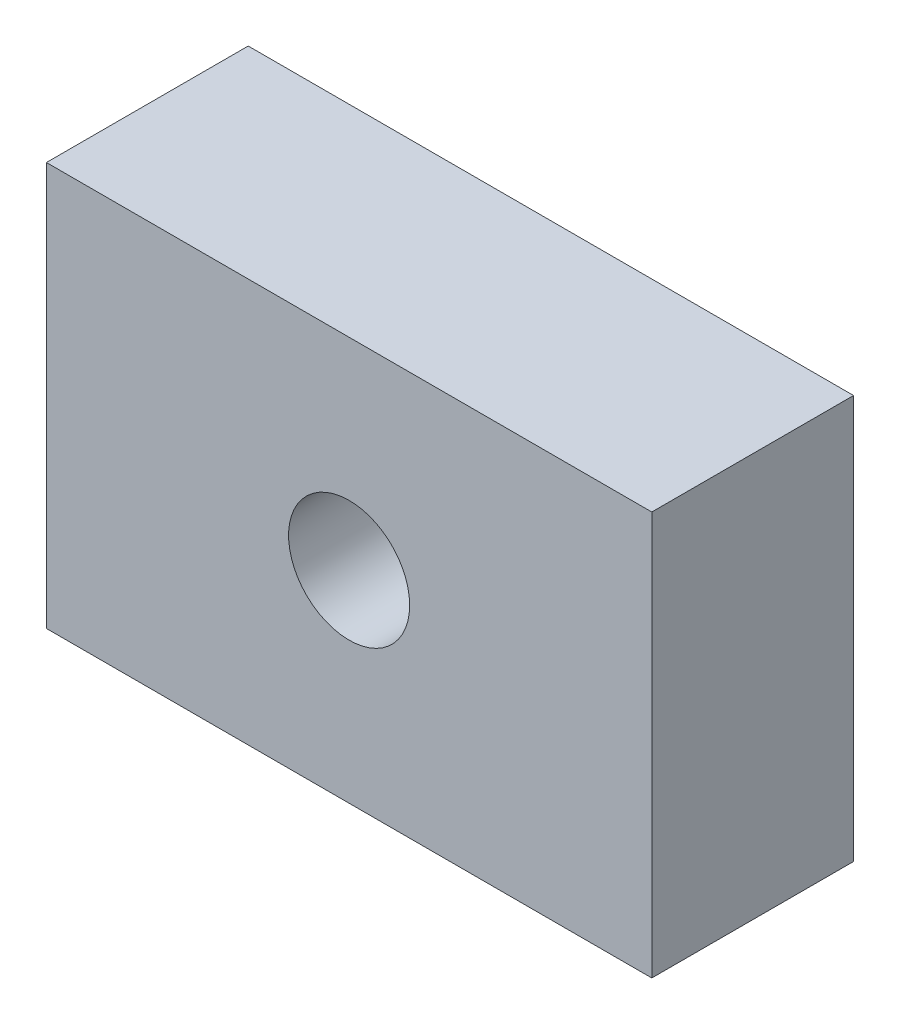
ISO-10303-21;
HEADER;
FILE_DESCRIPTION(('STEP AP214'),'2;1');
FILE_NAME('part.step','',(''),(''),'','','');
FILE_SCHEMA(('AUTOMOTIVE_DESIGN { 1 0 10303 214 1 1 1 1 }'));
ENDSEC;
DATA;
#1=APPLICATION_CONTEXT('core data for automotive mechanical design processes');
#2=APPLICATION_PROTOCOL_DEFINITION('international standard','automotive_design',2000,#1);
#3=PRODUCT_CONTEXT('',#1,'mechanical');
#4=PRODUCT('Part','Part','',(#3));
#5=PRODUCT_RELATED_PRODUCT_CATEGORY('part','',(#4));
#6=PRODUCT_DEFINITION_FORMATION('','',#4);
#7=PRODUCT_DEFINITION_CONTEXT('part definition',#1,'design');
#8=PRODUCT_DEFINITION('design','',#6,#7);
#9=PRODUCT_DEFINITION_SHAPE('','',#8);
#10=(LENGTH_UNIT() NAMED_UNIT(*) SI_UNIT(.MILLI.,.METRE.));
#11=(NAMED_UNIT(*) PLANE_ANGLE_UNIT() SI_UNIT($,.RADIAN.));
#12=(NAMED_UNIT(*) SI_UNIT($,.STERADIAN.) SOLID_ANGLE_UNIT());
#13=UNCERTAINTY_MEASURE_WITH_UNIT(LENGTH_MEASURE(1.E-05),#10,'distance_accuracy_value','');
#14=(GEOMETRIC_REPRESENTATION_CONTEXT(3) GLOBAL_UNCERTAINTY_ASSIGNED_CONTEXT((#13)) GLOBAL_UNIT_ASSIGNED_CONTEXT((#10,
#11,#12)) REPRESENTATION_CONTEXT('',''));
#15=CARTESIAN_POINT('',(0.,0.,0.));
#16=DIRECTION('',(0.,0.,1.));
#17=DIRECTION('',(1.,0.,0.));
#18=AXIS2_PLACEMENT_3D('',#15,#16,#17);
#19=CARTESIAN_POINT('',(-100.,-66.6666666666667,66.6666666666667));
#20=DIRECTION('',(1.,0.,0.));
#21=DIRECTION('',(0.,0.,-1.));
#22=AXIS2_PLACEMENT_3D('',#19,#20,#21);
#23=PLANE('',#22);
#24=DIRECTION('',(0.,-1.,0.));
#25=VECTOR('',#24,1.);
#26=CARTESIAN_POINT('',(-100.,-66.6666666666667,0.));
#27=LINE('',#26,#25);
#28=CARTESIAN_POINT('',(-100.,66.6666666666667,0.));
#29=VERTEX_POINT('',#28);
#30=CARTESIAN_POINT('',(-100.,-66.6666666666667,0.));
#31=VERTEX_POINT('',#30);
#32=EDGE_CURVE('E98',#29,#31,#27,.T.);
#33=ORIENTED_EDGE('',*,*,#32,.T.);
#34=DIRECTION('',(0.,0.,-1.));
#35=VECTOR('',#34,1.);
#36=CARTESIAN_POINT('',(-100.,-66.6666666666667,66.6666666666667));
#37=LINE('',#36,#35);
#38=CARTESIAN_POINT('',(-100.,-66.6666666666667,66.6666666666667));
#39=VERTEX_POINT('',#38);
#40=EDGE_CURVE('E11',#39,#31,#37,.T.);
#41=ORIENTED_EDGE('',*,*,#40,.F.);
#42=DIRECTION('',(0.,-1.,0.));
#43=VECTOR('',#42,1.);
#44=CARTESIAN_POINT('',(-100.,-66.6666666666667,66.6666666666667));
#45=LINE('',#44,#43);
#46=CARTESIAN_POINT('',(-100.,66.6666666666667,66.6666666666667));
#47=VERTEX_POINT('',#46);
#48=EDGE_CURVE('E86',#47,#39,#45,.T.);
#49=ORIENTED_EDGE('',*,*,#48,.F.);
#50=DIRECTION('',(0.,0.,-1.));
#51=VECTOR('',#50,1.);
#52=CARTESIAN_POINT('',(-100.,66.6666666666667,66.6666666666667));
#53=LINE('',#52,#51);
#54=EDGE_CURVE('E94',#47,#29,#53,.T.);
#55=ORIENTED_EDGE('',*,*,#54,.T.);
#56=EDGE_LOOP('',(#33,#41,#49,#55));
#57=FACE_BOUND('',#56,.T.);
#58=ADVANCED_FACE('F35',(#57),#23,.F.);
#59=CARTESIAN_POINT('',(100.,-66.6666666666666,66.6666666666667));
#60=DIRECTION('',(0.,1.,0.));
#61=DIRECTION('',(-1.,0.,0.));
#62=AXIS2_PLACEMENT_3D('',#59,#60,#61);
#63=PLANE('',#62);
#64=DIRECTION('',(1.,0.,0.));
#65=VECTOR('',#64,1.);
#66=CARTESIAN_POINT('',(100.,-66.6666666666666,0.));
#67=LINE('',#66,#65);
#68=CARTESIAN_POINT('',(100.,-66.6666666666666,0.));
#69=VERTEX_POINT('',#68);
#70=EDGE_CURVE('E90',#31,#69,#67,.T.);
#71=ORIENTED_EDGE('',*,*,#70,.T.);
#72=DIRECTION('',(0.,0.,-1.));
#73=VECTOR('',#72,1.);
#74=CARTESIAN_POINT('',(100.,-66.6666666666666,66.6666666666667));
#75=LINE('',#74,#73);
#76=CARTESIAN_POINT('',(100.,-66.6666666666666,66.6666666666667));
#77=VERTEX_POINT('',#76);
#78=EDGE_CURVE('E43',#77,#69,#75,.T.);
#79=ORIENTED_EDGE('',*,*,#78,.F.);
#80=DIRECTION('',(1.,0.,0.));
#81=VECTOR('',#80,1.);
#82=CARTESIAN_POINT('',(100.,-66.6666666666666,66.6666666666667));
#83=LINE('',#82,#81);
#84=EDGE_CURVE('E81',#39,#77,#83,.T.);
#85=ORIENTED_EDGE('',*,*,#84,.F.);
#86=ORIENTED_EDGE('',*,*,#40,.T.);
#87=EDGE_LOOP('',(#71,#79,#85,#86));
#88=FACE_BOUND('',#87,.T.);
#89=ADVANCED_FACE('F89',(#88),#63,.F.);
#90=CARTESIAN_POINT('',(100.,-66.6666666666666,66.6666666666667));
#91=DIRECTION('',(-1.,0.,0.));
#92=DIRECTION('',(0.,0.,1.));
#93=AXIS2_PLACEMENT_3D('',#90,#91,#92);
#94=PLANE('',#93);
#95=DIRECTION('',(0.,1.,0.));
#96=VECTOR('',#95,1.);
#97=CARTESIAN_POINT('',(100.,-66.6666666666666,0.));
#98=LINE('',#97,#96);
#99=CARTESIAN_POINT('',(100.,66.6666666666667,0.));
#100=VERTEX_POINT('',#99);
#101=EDGE_CURVE('E68',#69,#100,#98,.T.);
#102=ORIENTED_EDGE('',*,*,#101,.T.);
#103=DIRECTION('',(0.,0.,-1.));
#104=VECTOR('',#103,1.);
#105=CARTESIAN_POINT('',(100.,66.6666666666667,66.6666666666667));
#106=LINE('',#105,#104);
#107=CARTESIAN_POINT('',(100.,66.6666666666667,66.6666666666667));
#108=VERTEX_POINT('',#107);
#109=EDGE_CURVE('E91',#108,#100,#106,.T.);
#110=ORIENTED_EDGE('',*,*,#109,.F.);
#111=DIRECTION('',(0.,1.,0.));
#112=VECTOR('',#111,1.);
#113=CARTESIAN_POINT('',(100.,-66.6666666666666,66.6666666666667));
#114=LINE('',#113,#112);
#115=EDGE_CURVE('E84',#77,#108,#114,.T.);
#116=ORIENTED_EDGE('',*,*,#115,.F.);
#117=ORIENTED_EDGE('',*,*,#78,.T.);
#118=EDGE_LOOP('',(#102,#110,#116,#117));
#119=FACE_BOUND('',#118,.T.);
#120=ADVANCED_FACE('F92',(#119),#94,.F.);
#121=CARTESIAN_POINT('',(100.,66.6666666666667,66.6666666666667));
#122=DIRECTION('',(0.,-1.,0.));
#123=DIRECTION('',(1.,0.,0.));
#124=AXIS2_PLACEMENT_3D('',#121,#122,#123);
#125=PLANE('',#124);
#126=DIRECTION('',(-1.,0.,0.));
#127=VECTOR('',#126,1.);
#128=CARTESIAN_POINT('',(100.,66.6666666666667,0.));
#129=LINE('',#128,#127);
#130=EDGE_CURVE('E74',#100,#29,#129,.T.);
#131=ORIENTED_EDGE('',*,*,#130,.T.);
#132=ORIENTED_EDGE('',*,*,#54,.F.);
#133=DIRECTION('',(-1.,0.,0.));
#134=VECTOR('',#133,1.);
#135=CARTESIAN_POINT('',(100.,66.6666666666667,66.6666666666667));
#136=LINE('',#135,#134);
#137=EDGE_CURVE('E51',#108,#47,#136,.T.);
#138=ORIENTED_EDGE('',*,*,#137,.F.);
#139=ORIENTED_EDGE('',*,*,#109,.T.);
#140=EDGE_LOOP('',(#131,#132,#138,#139));
#141=FACE_BOUND('',#140,.T.);
#142=ADVANCED_FACE('F106',(#141),#125,.F.);
#143=CARTESIAN_POINT('',(0.,0.,66.6666666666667));
#144=DIRECTION('',(0.,0.,1.));
#145=DIRECTION('',(1.,0.,0.));
#146=AXIS2_PLACEMENT_3D('',#143,#144,#145);
#147=PLANE('',#146);
#148=CARTESIAN_POINT('',(0.,0.,66.6666666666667));
#149=DIRECTION('',(0.,0.,1.));
#150=DIRECTION('',(1.,0.,0.));
#151=AXIS2_PLACEMENT_3D('',#148,#149,#150);
#152=CIRCLE('',#151,20.);
#153=CARTESIAN_POINT('',(20.,0.,66.6666666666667));
#154=VERTEX_POINT('',#153);
#155=EDGE_CURVE('E112',#154,#154,#152,.T.);
#156=ORIENTED_EDGE('',*,*,#155,.F.);
#157=EDGE_LOOP('',(#156));
#158=FACE_BOUND('',#157,.T.);
#159=ORIENTED_EDGE('',*,*,#48,.T.);
#160=ORIENTED_EDGE('',*,*,#84,.T.);
#161=ORIENTED_EDGE('',*,*,#115,.T.);
#162=ORIENTED_EDGE('',*,*,#137,.T.);
#163=EDGE_LOOP('',(#159,#160,#161,#162));
#164=FACE_BOUND('',#163,.T.);
#165=ADVANCED_FACE('F82',(#158,#164),#147,.T.);
#166=CARTESIAN_POINT('',(0.,0.,0.));
#167=DIRECTION('',(0.,0.,1.));
#168=DIRECTION('',(1.,0.,0.));
#169=AXIS2_PLACEMENT_3D('',#166,#167,#168);
#170=PLANE('',#169);
#171=CARTESIAN_POINT('',(0.,0.,0.));
#172=DIRECTION('',(0.,0.,1.));
#173=DIRECTION('',(1.,0.,0.));
#174=AXIS2_PLACEMENT_3D('',#171,#172,#173);
#175=CIRCLE('',#174,20.);
#176=CARTESIAN_POINT('',(20.,0.,0.));
#177=VERTEX_POINT('',#176);
#178=EDGE_CURVE('E101',#177,#177,#175,.T.);
#179=ORIENTED_EDGE('',*,*,#178,.T.);
#180=EDGE_LOOP('',(#179));
#181=FACE_BOUND('',#180,.T.);
#182=ORIENTED_EDGE('',*,*,#32,.F.);
#183=ORIENTED_EDGE('',*,*,#130,.F.);
#184=ORIENTED_EDGE('',*,*,#101,.F.);
#185=ORIENTED_EDGE('',*,*,#70,.F.);
#186=EDGE_LOOP('',(#182,#183,#184,#185));
#187=FACE_BOUND('',#186,.T.);
#188=ADVANCED_FACE('F109',(#181,#187),#170,.F.);
#189=CARTESIAN_POINT('',(0.,0.,0.));
#190=DIRECTION('',(0.,0.,1.));
#191=DIRECTION('',(1.,0.,0.));
#192=AXIS2_PLACEMENT_3D('',#189,#190,#191);
#193=CYLINDRICAL_SURFACE('',#192,20.);
#194=ORIENTED_EDGE('',*,*,#178,.F.);
#195=EDGE_LOOP('',(#194));
#196=FACE_BOUND('',#195,.T.);
#197=ORIENTED_EDGE('',*,*,#155,.T.);
#198=EDGE_LOOP('',(#197));
#199=FACE_BOUND('',#198,.T.);
#200=ADVANCED_FACE('F119',(#196,#199),#193,.F.);
#201=CLOSED_SHELL('',(#58,#89,#120,#142,#165,#188,#200));
#202=MANIFOLD_SOLID_BREP('B2',#201);
#203=ADVANCED_BREP_SHAPE_REPRESENTATION('',(#18,#202),#14);
#204=SHAPE_DEFINITION_REPRESENTATION(#9,#203);
ENDSEC;
END-ISO-10303-21;
